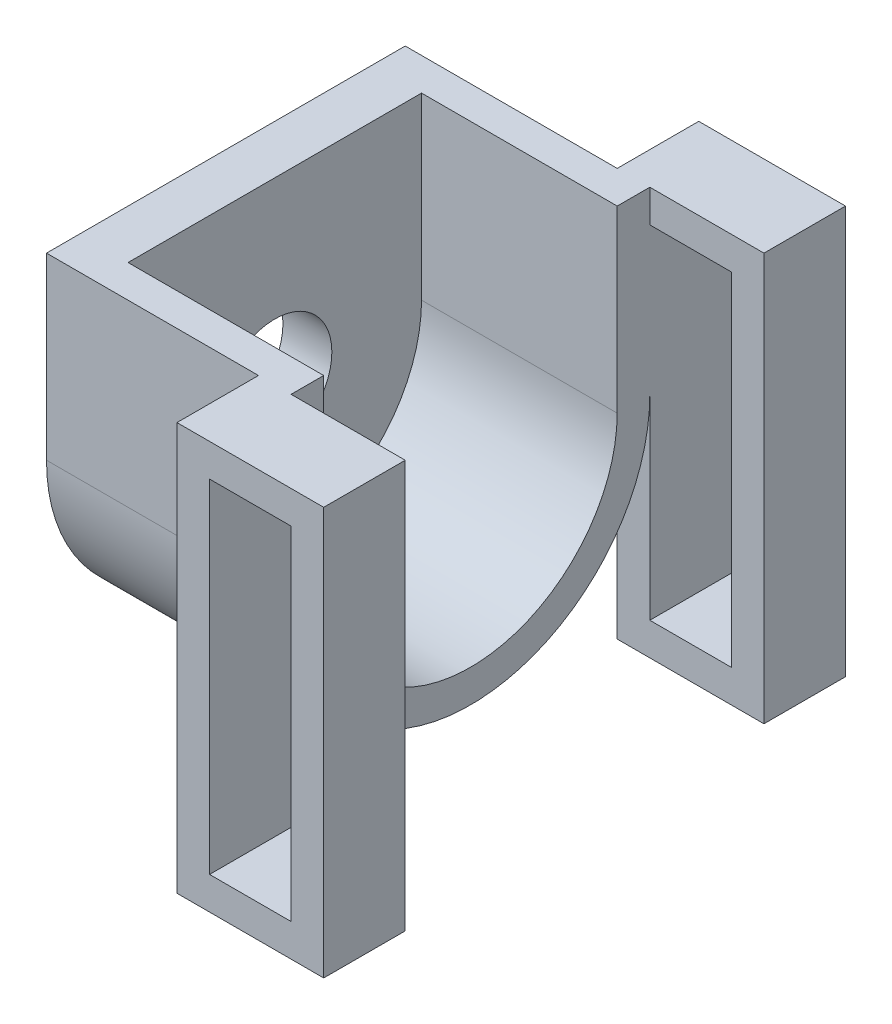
ISO-10303-21;
HEADER;
FILE_DESCRIPTION(('STEP AP214'),'2;1');
FILE_NAME('part.step','',(''),(''),'','','');
FILE_SCHEMA(('AUTOMOTIVE_DESIGN { 1 0 10303 214 1 1 1 1 }'));
ENDSEC;
DATA;
#1=APPLICATION_CONTEXT('core data for automotive mechanical design processes');
#2=APPLICATION_PROTOCOL_DEFINITION('international standard','automotive_design',2000,#1);
#3=PRODUCT_CONTEXT('',#1,'mechanical');
#4=PRODUCT('Part','Part','',(#3));
#5=PRODUCT_RELATED_PRODUCT_CATEGORY('part','',(#4));
#6=PRODUCT_DEFINITION_FORMATION('','',#4);
#7=PRODUCT_DEFINITION_CONTEXT('part definition',#1,'design');
#8=PRODUCT_DEFINITION('design','',#6,#7);
#9=PRODUCT_DEFINITION_SHAPE('','',#8);
#10=(LENGTH_UNIT() NAMED_UNIT(*) SI_UNIT(.MILLI.,.METRE.));
#11=(NAMED_UNIT(*) PLANE_ANGLE_UNIT() SI_UNIT($,.RADIAN.));
#12=(NAMED_UNIT(*) SI_UNIT($,.STERADIAN.) SOLID_ANGLE_UNIT());
#13=UNCERTAINTY_MEASURE_WITH_UNIT(LENGTH_MEASURE(1.E-05),#10,'distance_accuracy_value','');
#14=(GEOMETRIC_REPRESENTATION_CONTEXT(3) GLOBAL_UNCERTAINTY_ASSIGNED_CONTEXT((#13)) GLOBAL_UNIT_ASSIGNED_CONTEXT((#10,
#11,#12)) REPRESENTATION_CONTEXT('',''));
#15=CARTESIAN_POINT('',(0.,0.,0.));
#16=DIRECTION('',(0.,0.,1.));
#17=DIRECTION('',(1.,0.,0.));
#18=AXIS2_PLACEMENT_3D('',#15,#16,#17);
#19=CARTESIAN_POINT('',(15.,0.,0.));
#20=DIRECTION('',(1.,0.,0.));
#21=DIRECTION('',(0.,0.,-1.));
#22=AXIS2_PLACEMENT_3D('',#19,#20,#21);
#23=PLANE('',#22);
#24=DIRECTION('',(0.,1.,0.));
#25=VECTOR('',#24,1.);
#26=CARTESIAN_POINT('',(15.,0.,9.));
#27=LINE('',#26,#25);
#28=CARTESIAN_POINT('',(15.,0.,9.));
#29=VERTEX_POINT('',#28);
#30=CARTESIAN_POINT('',(15.,11.,9.));
#31=VERTEX_POINT('',#30);
#32=EDGE_CURVE('E384',#29,#31,#27,.T.);
#33=ORIENTED_EDGE('',*,*,#32,.T.);
#34=DIRECTION('',(0.,0.,1.));
#35=VECTOR('',#34,1.);
#36=CARTESIAN_POINT('',(15.,11.,11.));
#37=LINE('',#36,#35);
#38=CARTESIAN_POINT('',(15.,11.,11.));
#39=VERTEX_POINT('',#38);
#40=EDGE_CURVE('E433',#31,#39,#37,.T.);
#41=ORIENTED_EDGE('',*,*,#40,.T.);
#42=DIRECTION('',(0.,1.,0.));
#43=VECTOR('',#42,1.);
#44=CARTESIAN_POINT('',(15.,-14.,11.));
#45=LINE('',#44,#43);
#46=CARTESIAN_POINT('',(15.,9.,11.));
#47=VERTEX_POINT('',#46);
#48=EDGE_CURVE('E278',#47,#39,#45,.T.);
#49=ORIENTED_EDGE('',*,*,#48,.F.);
#50=DIRECTION('',(0.,0.,1.));
#51=VECTOR('',#50,1.);
#52=CARTESIAN_POINT('',(15.,9.,-16.));
#53=LINE('',#52,#51);
#54=CARTESIAN_POINT('',(15.,9.,16.));
#55=VERTEX_POINT('',#54);
#56=EDGE_CURVE('E264',#47,#55,#53,.T.);
#57=ORIENTED_EDGE('',*,*,#56,.T.);
#58=DIRECTION('',(0.,-1.,0.));
#59=VECTOR('',#58,1.);
#60=CARTESIAN_POINT('',(15.,9.,16.));
#61=LINE('',#60,#59);
#62=CARTESIAN_POINT('',(15.,-12.,16.));
#63=VERTEX_POINT('',#62);
#64=EDGE_CURVE('E234',#55,#63,#61,.T.);
#65=ORIENTED_EDGE('',*,*,#64,.T.);
#66=DIRECTION('',(0.,0.,1.));
#67=VECTOR('',#66,1.);
#68=CARTESIAN_POINT('',(15.,-12.,-16.));
#69=LINE('',#68,#67);
#70=CARTESIAN_POINT('',(15.,-12.,11.));
#71=VERTEX_POINT('',#70);
#72=EDGE_CURVE('E259',#71,#63,#69,.T.);
#73=ORIENTED_EDGE('',*,*,#72,.F.);
#74=DIRECTION('',(0.,-1.,0.));
#75=VECTOR('',#74,1.);
#76=CARTESIAN_POINT('',(15.,-14.,11.));
#77=LINE('',#76,#75);
#78=CARTESIAN_POINT('',(15.,0.,11.));
#79=VERTEX_POINT('',#78);
#80=EDGE_CURVE('E11',#79,#71,#77,.T.);
#81=ORIENTED_EDGE('',*,*,#80,.F.);
#82=CARTESIAN_POINT('',(15.,0.,0.));
#83=DIRECTION('',(1.,0.,0.));
#84=DIRECTION('',(0.,0.,-1.));
#85=AXIS2_PLACEMENT_3D('',#82,#83,#84);
#86=CIRCLE('',#85,11.);
#87=CARTESIAN_POINT('',(15.,0.,-11.));
#88=VERTEX_POINT('',#87);
#89=EDGE_CURVE('E429',#79,#88,#86,.T.);
#90=ORIENTED_EDGE('',*,*,#89,.T.);
#91=DIRECTION('',(0.,-1.,0.));
#92=VECTOR('',#91,1.);
#93=CARTESIAN_POINT('',(15.,-14.,-11.));
#94=LINE('',#93,#92);
#95=CARTESIAN_POINT('',(15.,-12.,-11.));
#96=VERTEX_POINT('',#95);
#97=EDGE_CURVE('E273',#88,#96,#94,.T.);
#98=ORIENTED_EDGE('',*,*,#97,.T.);
#99=CARTESIAN_POINT('',(15.,-12.,-16.));
#100=VERTEX_POINT('',#99);
#101=EDGE_CURVE('E255',#100,#96,#69,.T.);
#102=ORIENTED_EDGE('',*,*,#101,.F.);
#103=DIRECTION('',(0.,-1.,0.));
#104=VECTOR('',#103,1.);
#105=CARTESIAN_POINT('',(15.,9.,-16.));
#106=LINE('',#105,#104);
#107=CARTESIAN_POINT('',(15.,9.,-16.));
#108=VERTEX_POINT('',#107);
#109=EDGE_CURVE('E232',#108,#100,#106,.T.);
#110=ORIENTED_EDGE('',*,*,#109,.F.);
#111=CARTESIAN_POINT('',(15.,9.,-11.));
#112=VERTEX_POINT('',#111);
#113=EDGE_CURVE('E260',#108,#112,#53,.T.);
#114=ORIENTED_EDGE('',*,*,#113,.T.);
#115=DIRECTION('',(0.,1.,0.));
#116=VECTOR('',#115,1.);
#117=CARTESIAN_POINT('',(15.,-14.,-11.));
#118=LINE('',#117,#116);
#119=CARTESIAN_POINT('',(15.,11.,-11.));
#120=VERTEX_POINT('',#119);
#121=EDGE_CURVE('E344',#112,#120,#118,.T.);
#122=ORIENTED_EDGE('',*,*,#121,.T.);
#123=CARTESIAN_POINT('',(15.,11.,-9.));
#124=VERTEX_POINT('',#123);
#125=EDGE_CURVE('E435',#120,#124,#37,.T.);
#126=ORIENTED_EDGE('',*,*,#125,.T.);
#127=DIRECTION('',(0.,1.,0.));
#128=VECTOR('',#127,1.);
#129=CARTESIAN_POINT('',(15.,0.,-9.));
#130=LINE('',#129,#128);
#131=CARTESIAN_POINT('',(15.,0.,-9.));
#132=VERTEX_POINT('',#131);
#133=EDGE_CURVE('E408',#132,#124,#130,.T.);
#134=ORIENTED_EDGE('',*,*,#133,.F.);
#135=CARTESIAN_POINT('',(15.,0.,0.));
#136=DIRECTION('',(1.,0.,0.));
#137=DIRECTION('',(0.,0.,-1.));
#138=AXIS2_PLACEMENT_3D('',#135,#136,#137);
#139=CIRCLE('',#138,9.);
#140=EDGE_CURVE('E393',#29,#132,#139,.T.);
#141=ORIENTED_EDGE('',*,*,#140,.F.);
#142=EDGE_LOOP('',(#33,#41,#49,#57,#65,#73,#81,#90,#98,#102,#110,#114,#122,#126,#134,#141));
#143=FACE_BOUND('',#142,.T.);
#144=ADVANCED_FACE('F43',(#143),#23,.T.);
#145=CARTESIAN_POINT('',(15.,0.,11.));
#146=DIRECTION('',(0.,0.,-1.));
#147=DIRECTION('',(-1.,0.,0.));
#148=AXIS2_PLACEMENT_3D('',#145,#146,#147);
#149=PLANE('',#148);
#150=DIRECTION('',(0.,-1.,0.));
#151=VECTOR('',#150,1.);
#152=CARTESIAN_POINT('',(13.,11.,11.));
#153=LINE('',#152,#151);
#154=CARTESIAN_POINT('',(13.,11.,11.));
#155=VERTEX_POINT('',#154);
#156=CARTESIAN_POINT('',(13.,0.,11.));
#157=VERTEX_POINT('',#156);
#158=EDGE_CURVE('E313',#155,#157,#153,.T.);
#159=ORIENTED_EDGE('',*,*,#158,.F.);
#160=DIRECTION('',(-1.,0.,0.));
#161=VECTOR('',#160,1.);
#162=CARTESIAN_POINT('',(15.,11.,11.));
#163=LINE('',#162,#161);
#164=CARTESIAN_POINT('',(0.,11.,11.));
#165=VERTEX_POINT('',#164);
#166=EDGE_CURVE('E457',#155,#165,#163,.T.);
#167=ORIENTED_EDGE('',*,*,#166,.T.);
#168=DIRECTION('',(0.,-1.,0.));
#169=VECTOR('',#168,1.);
#170=CARTESIAN_POINT('',(0.,0.,11.));
#171=LINE('',#170,#169);
#172=CARTESIAN_POINT('',(0.,0.,11.));
#173=VERTEX_POINT('',#172);
#174=EDGE_CURVE('E434',#165,#173,#171,.T.);
#175=ORIENTED_EDGE('',*,*,#174,.T.);
#176=DIRECTION('',(-1.,0.,0.));
#177=VECTOR('',#176,1.);
#178=CARTESIAN_POINT('',(15.,0.,11.));
#179=LINE('',#178,#177);
#180=EDGE_CURVE('E439',#157,#173,#179,.T.);
#181=ORIENTED_EDGE('',*,*,#180,.F.);
#182=EDGE_LOOP('',(#159,#167,#175,#181));
#183=FACE_BOUND('',#182,.T.);
#184=ADVANCED_FACE('F529',(#183),#149,.F.);
#185=CARTESIAN_POINT('',(15.,11.,11.));
#186=DIRECTION('',(0.,-1.,0.));
#187=DIRECTION('',(0.,0.,-1.));
#188=AXIS2_PLACEMENT_3D('',#185,#186,#187);
#189=PLANE('',#188);
#190=DIRECTION('',(1.,0.,0.));
#191=VECTOR('',#190,1.);
#192=CARTESIAN_POINT('',(3.,11.,9.));
#193=LINE('',#192,#191);
#194=CARTESIAN_POINT('',(3.,11.,9.));
#195=VERTEX_POINT('',#194);
#196=EDGE_CURVE('E424',#195,#31,#193,.T.);
#197=ORIENTED_EDGE('',*,*,#196,.F.);
#198=DIRECTION('',(0.,0.,-1.));
#199=VECTOR('',#198,1.);
#200=CARTESIAN_POINT('',(3.,11.,9.));
#201=LINE('',#200,#199);
#202=CARTESIAN_POINT('',(3.,11.,-9.));
#203=VERTEX_POINT('',#202);
#204=EDGE_CURVE('E392',#195,#203,#201,.T.);
#205=ORIENTED_EDGE('',*,*,#204,.T.);
#206=DIRECTION('',(1.,0.,0.));
#207=VECTOR('',#206,1.);
#208=CARTESIAN_POINT('',(3.,11.,-9.));
#209=LINE('',#208,#207);
#210=EDGE_CURVE('E420',#203,#124,#209,.T.);
#211=ORIENTED_EDGE('',*,*,#210,.T.);
#212=ORIENTED_EDGE('',*,*,#125,.F.);
#213=DIRECTION('',(-1.,0.,0.));
#214=VECTOR('',#213,1.);
#215=CARTESIAN_POINT('',(22.,11.,-11.));
#216=LINE('',#215,#214);
#217=CARTESIAN_POINT('',(22.,11.,-11.));
#218=VERTEX_POINT('',#217);
#219=EDGE_CURVE('E343',#218,#120,#216,.T.);
#220=ORIENTED_EDGE('',*,*,#219,.F.);
#221=DIRECTION('',(0.,0.,-1.));
#222=VECTOR('',#221,1.);
#223=CARTESIAN_POINT('',(22.,11.,-11.));
#224=LINE('',#223,#222);
#225=CARTESIAN_POINT('',(22.,11.,-16.));
#226=VERTEX_POINT('',#225);
#227=EDGE_CURVE('E327',#218,#226,#224,.T.);
#228=ORIENTED_EDGE('',*,*,#227,.T.);
#229=DIRECTION('',(-1.,0.,0.));
#230=VECTOR('',#229,1.);
#231=CARTESIAN_POINT('',(15.,11.,-16.));
#232=LINE('',#231,#230);
#233=CARTESIAN_POINT('',(13.,11.,-16.));
#234=VERTEX_POINT('',#233);
#235=EDGE_CURVE('E369',#226,#234,#232,.T.);
#236=ORIENTED_EDGE('',*,*,#235,.T.);
#237=DIRECTION('',(0.,0.,1.));
#238=VECTOR('',#237,1.);
#239=CARTESIAN_POINT('',(13.,11.,-16.));
#240=LINE('',#239,#238);
#241=CARTESIAN_POINT('',(13.,11.,-11.));
#242=VERTEX_POINT('',#241);
#243=EDGE_CURVE('E373',#234,#242,#240,.T.);
#244=ORIENTED_EDGE('',*,*,#243,.T.);
#245=DIRECTION('',(-1.,0.,0.));
#246=VECTOR('',#245,1.);
#247=CARTESIAN_POINT('',(15.,11.,-11.));
#248=LINE('',#247,#246);
#249=CARTESIAN_POINT('',(0.,11.,-11.));
#250=VERTEX_POINT('',#249);
#251=EDGE_CURVE('E460',#242,#250,#248,.T.);
#252=ORIENTED_EDGE('',*,*,#251,.T.);
#253=DIRECTION('',(0.,0.,1.));
#254=VECTOR('',#253,1.);
#255=CARTESIAN_POINT('',(0.,11.,11.));
#256=LINE('',#255,#254);
#257=EDGE_CURVE('E447',#250,#165,#256,.T.);
#258=ORIENTED_EDGE('',*,*,#257,.T.);
#259=ORIENTED_EDGE('',*,*,#166,.F.);
#260=DIRECTION('',(0.,0.,-1.));
#261=VECTOR('',#260,1.);
#262=CARTESIAN_POINT('',(13.,11.,16.));
#263=LINE('',#262,#261);
#264=CARTESIAN_POINT('',(13.,11.,16.));
#265=VERTEX_POINT('',#264);
#266=EDGE_CURVE('E320',#265,#155,#263,.T.);
#267=ORIENTED_EDGE('',*,*,#266,.F.);
#268=DIRECTION('',(-1.,0.,0.));
#269=VECTOR('',#268,1.);
#270=CARTESIAN_POINT('',(15.,11.,16.));
#271=LINE('',#270,#269);
#272=CARTESIAN_POINT('',(22.,11.,16.));
#273=VERTEX_POINT('',#272);
#274=EDGE_CURVE('E317',#273,#265,#271,.T.);
#275=ORIENTED_EDGE('',*,*,#274,.F.);
#276=DIRECTION('',(0.,0.,1.));
#277=VECTOR('',#276,1.);
#278=CARTESIAN_POINT('',(22.,11.,11.));
#279=LINE('',#278,#277);
#280=CARTESIAN_POINT('',(22.,11.,11.));
#281=VERTEX_POINT('',#280);
#282=EDGE_CURVE('E279',#281,#273,#279,.T.);
#283=ORIENTED_EDGE('',*,*,#282,.F.);
#284=DIRECTION('',(-1.,0.,0.));
#285=VECTOR('',#284,1.);
#286=CARTESIAN_POINT('',(22.,11.,11.));
#287=LINE('',#286,#285);
#288=EDGE_CURVE('E294',#281,#39,#287,.T.);
#289=ORIENTED_EDGE('',*,*,#288,.T.);
#290=ORIENTED_EDGE('',*,*,#40,.F.);
#291=EDGE_LOOP('',(#197,#205,#211,#212,#220,#228,#236,#244,#252,#258,#259,#267,#275,#283,#289,#290));
#292=FACE_BOUND('',#291,.T.);
#293=ADVANCED_FACE('F510',(#292),#189,.F.);
#294=CARTESIAN_POINT('',(15.,0.,0.));
#295=DIRECTION('',(-1.,0.,0.));
#296=DIRECTION('',(0.,0.,1.));
#297=AXIS2_PLACEMENT_3D('',#294,#295,#296);
#298=CYLINDRICAL_SURFACE('',#297,11.);
#299=CARTESIAN_POINT('',(0.,0.,0.));
#300=DIRECTION('',(1.,0.,0.));
#301=DIRECTION('',(0.,0.,-1.));
#302=AXIS2_PLACEMENT_3D('',#299,#300,#301);
#303=CIRCLE('',#302,11.);
#304=CARTESIAN_POINT('',(0.,0.,-11.));
#305=VERTEX_POINT('',#304);
#306=EDGE_CURVE('E428',#173,#305,#303,.T.);
#307=ORIENTED_EDGE('',*,*,#306,.T.);
#308=DIRECTION('',(-1.,0.,0.));
#309=VECTOR('',#308,1.);
#310=CARTESIAN_POINT('',(15.,0.,-11.));
#311=LINE('',#310,#309);
#312=CARTESIAN_POINT('',(13.,0.,-11.));
#313=VERTEX_POINT('',#312);
#314=EDGE_CURVE('E463',#313,#305,#311,.T.);
#315=ORIENTED_EDGE('',*,*,#314,.F.);
#316=EDGE_CURVE('E348',#88,#313,#311,.T.);
#317=ORIENTED_EDGE('',*,*,#316,.F.);
#318=ORIENTED_EDGE('',*,*,#89,.F.);
#319=EDGE_CURVE('E454',#79,#157,#179,.T.);
#320=ORIENTED_EDGE('',*,*,#319,.T.);
#321=ORIENTED_EDGE('',*,*,#180,.T.);
#322=EDGE_LOOP('',(#307,#315,#317,#318,#320,#321));
#323=FACE_BOUND('',#322,.T.);
#324=ADVANCED_FACE('F45',(#323),#298,.T.);
#325=CARTESIAN_POINT('',(15.,0.,-11.));
#326=DIRECTION('',(0.,0.,1.));
#327=DIRECTION('',(1.,0.,0.));
#328=AXIS2_PLACEMENT_3D('',#325,#326,#327);
#329=PLANE('',#328);
#330=ORIENTED_EDGE('',*,*,#251,.F.);
#331=DIRECTION('',(0.,-1.,0.));
#332=VECTOR('',#331,1.);
#333=CARTESIAN_POINT('',(13.,11.,-11.));
#334=LINE('',#333,#332);
#335=EDGE_CURVE('E365',#242,#313,#334,.T.);
#336=ORIENTED_EDGE('',*,*,#335,.T.);
#337=ORIENTED_EDGE('',*,*,#314,.T.);
#338=DIRECTION('',(0.,1.,0.));
#339=VECTOR('',#338,1.);
#340=CARTESIAN_POINT('',(0.,0.,-11.));
#341=LINE('',#340,#339);
#342=EDGE_CURVE('E443',#305,#250,#341,.T.);
#343=ORIENTED_EDGE('',*,*,#342,.T.);
#344=EDGE_LOOP('',(#330,#336,#337,#343));
#345=FACE_BOUND('',#344,.T.);
#346=ADVANCED_FACE('F539',(#345),#329,.F.);
#347=CARTESIAN_POINT('',(0.,0.,0.));
#348=DIRECTION('',(1.,0.,0.));
#349=DIRECTION('',(0.,0.,-1.));
#350=AXIS2_PLACEMENT_3D('',#347,#348,#349);
#351=PLANE('',#350);
#352=CARTESIAN_POINT('',(0.,0.,0.));
#353=DIRECTION('',(1.,0.,0.));
#354=DIRECTION('',(0.,0.,-1.));
#355=AXIS2_PLACEMENT_3D('',#352,#353,#354);
#356=CIRCLE('',#355,3.5);
#357=CARTESIAN_POINT('',(0.,0.,-3.5));
#358=VERTEX_POINT('',#357);
#359=EDGE_CURVE('E380',#358,#358,#356,.T.);
#360=ORIENTED_EDGE('',*,*,#359,.T.);
#361=EDGE_LOOP('',(#360));
#362=FACE_BOUND('',#361,.T.);
#363=ORIENTED_EDGE('',*,*,#306,.F.);
#364=ORIENTED_EDGE('',*,*,#174,.F.);
#365=ORIENTED_EDGE('',*,*,#257,.F.);
#366=ORIENTED_EDGE('',*,*,#342,.F.);
#367=EDGE_LOOP('',(#363,#364,#365,#366));
#368=FACE_BOUND('',#367,.T.);
#369=ADVANCED_FACE('F543',(#362,#368),#351,.F.);
#370=CARTESIAN_POINT('',(3.,0.,9.));
#371=DIRECTION('',(0.,0.,-1.));
#372=DIRECTION('',(-1.,0.,0.));
#373=AXIS2_PLACEMENT_3D('',#370,#371,#372);
#374=PLANE('',#373);
#375=ORIENTED_EDGE('',*,*,#32,.F.);
#376=DIRECTION('',(1.,0.,0.));
#377=VECTOR('',#376,1.);
#378=CARTESIAN_POINT('',(3.,0.,9.));
#379=LINE('',#378,#377);
#380=CARTESIAN_POINT('',(3.,0.,9.));
#381=VERTEX_POINT('',#380);
#382=EDGE_CURVE('E405',#381,#29,#379,.T.);
#383=ORIENTED_EDGE('',*,*,#382,.F.);
#384=DIRECTION('',(0.,1.,0.));
#385=VECTOR('',#384,1.);
#386=CARTESIAN_POINT('',(3.,0.,9.));
#387=LINE('',#386,#385);
#388=EDGE_CURVE('E388',#381,#195,#387,.T.);
#389=ORIENTED_EDGE('',*,*,#388,.T.);
#390=ORIENTED_EDGE('',*,*,#196,.T.);
#391=EDGE_LOOP('',(#375,#383,#389,#390));
#392=FACE_BOUND('',#391,.T.);
#393=ADVANCED_FACE('F567',(#392),#374,.T.);
#394=CARTESIAN_POINT('',(3.,0.,-9.));
#395=DIRECTION('',(0.,0.,-1.));
#396=DIRECTION('',(-1.,0.,0.));
#397=AXIS2_PLACEMENT_3D('',#394,#395,#396);
#398=PLANE('',#397);
#399=ORIENTED_EDGE('',*,*,#133,.T.);
#400=ORIENTED_EDGE('',*,*,#210,.F.);
#401=DIRECTION('',(0.,1.,0.));
#402=VECTOR('',#401,1.);
#403=CARTESIAN_POINT('',(3.,0.,-9.));
#404=LINE('',#403,#402);
#405=CARTESIAN_POINT('',(3.,0.,-9.));
#406=VERTEX_POINT('',#405);
#407=EDGE_CURVE('E397',#406,#203,#404,.T.);
#408=ORIENTED_EDGE('',*,*,#407,.F.);
#409=DIRECTION('',(1.,0.,0.));
#410=VECTOR('',#409,1.);
#411=CARTESIAN_POINT('',(3.,0.,-9.));
#412=LINE('',#411,#410);
#413=EDGE_CURVE('E417',#406,#132,#412,.T.);
#414=ORIENTED_EDGE('',*,*,#413,.T.);
#415=EDGE_LOOP('',(#399,#400,#408,#414));
#416=FACE_BOUND('',#415,.T.);
#417=ADVANCED_FACE('F559',(#416),#398,.F.);
#418=CARTESIAN_POINT('',(3.,0.,0.));
#419=DIRECTION('',(1.,0.,0.));
#420=DIRECTION('',(0.,0.,-1.));
#421=AXIS2_PLACEMENT_3D('',#418,#419,#420);
#422=CYLINDRICAL_SURFACE('',#421,9.);
#423=ORIENTED_EDGE('',*,*,#140,.T.);
#424=ORIENTED_EDGE('',*,*,#413,.F.);
#425=CARTESIAN_POINT('',(3.,0.,0.));
#426=DIRECTION('',(1.,0.,0.));
#427=DIRECTION('',(0.,0.,-1.));
#428=AXIS2_PLACEMENT_3D('',#425,#426,#427);
#429=CIRCLE('',#428,9.);
#430=EDGE_CURVE('E401',#381,#406,#429,.T.);
#431=ORIENTED_EDGE('',*,*,#430,.F.);
#432=ORIENTED_EDGE('',*,*,#382,.T.);
#433=EDGE_LOOP('',(#423,#424,#431,#432));
#434=FACE_BOUND('',#433,.T.);
#435=ADVANCED_FACE('F565',(#434),#422,.F.);
#436=CARTESIAN_POINT('',(3.,0.,0.));
#437=DIRECTION('',(1.,0.,0.));
#438=DIRECTION('',(0.,0.,-1.));
#439=AXIS2_PLACEMENT_3D('',#436,#437,#438);
#440=PLANE('',#439);
#441=CARTESIAN_POINT('',(3.,0.,0.));
#442=DIRECTION('',(1.,0.,0.));
#443=DIRECTION('',(0.,0.,-1.));
#444=AXIS2_PLACEMENT_3D('',#441,#442,#443);
#445=CIRCLE('',#444,3.5);
#446=CARTESIAN_POINT('',(3.,0.,-3.5));
#447=VERTEX_POINT('',#446);
#448=EDGE_CURVE('E379',#447,#447,#445,.T.);
#449=ORIENTED_EDGE('',*,*,#448,.F.);
#450=EDGE_LOOP('',(#449));
#451=FACE_BOUND('',#450,.T.);
#452=ORIENTED_EDGE('',*,*,#388,.F.);
#453=ORIENTED_EDGE('',*,*,#430,.T.);
#454=ORIENTED_EDGE('',*,*,#407,.T.);
#455=ORIENTED_EDGE('',*,*,#204,.F.);
#456=EDGE_LOOP('',(#452,#453,#454,#455));
#457=FACE_BOUND('',#456,.T.);
#458=ADVANCED_FACE('F562',(#451,#457),#440,.T.);
#459=CARTESIAN_POINT('',(0.,0.,0.));
#460=DIRECTION('',(1.,0.,0.));
#461=DIRECTION('',(0.,0.,-1.));
#462=AXIS2_PLACEMENT_3D('',#459,#460,#461);
#463=CYLINDRICAL_SURFACE('',#462,3.5);
#464=ORIENTED_EDGE('',*,*,#359,.F.);
#465=EDGE_LOOP('',(#464));
#466=FACE_BOUND('',#465,.T.);
#467=ORIENTED_EDGE('',*,*,#448,.T.);
#468=EDGE_LOOP('',(#467));
#469=FACE_BOUND('',#468,.T.);
#470=ADVANCED_FACE('F848',(#466,#469),#463,.F.);
#471=CARTESIAN_POINT('',(13.,11.,-16.));
#472=DIRECTION('',(-1.,0.,0.));
#473=DIRECTION('',(0.,-1.,0.));
#474=AXIS2_PLACEMENT_3D('',#471,#472,#473);
#475=PLANE('',#474);
#476=ORIENTED_EDGE('',*,*,#335,.F.);
#477=ORIENTED_EDGE('',*,*,#243,.F.);
#478=DIRECTION('',(0.,-1.,0.));
#479=VECTOR('',#478,1.);
#480=CARTESIAN_POINT('',(13.,11.,-16.));
#481=LINE('',#480,#479);
#482=CARTESIAN_POINT('',(13.,-14.,-16.));
#483=VERTEX_POINT('',#482);
#484=EDGE_CURVE('E366',#234,#483,#481,.T.);
#485=ORIENTED_EDGE('',*,*,#484,.T.);
#486=DIRECTION('',(0.,0.,-1.));
#487=VECTOR('',#486,1.);
#488=CARTESIAN_POINT('',(13.,-14.,-11.));
#489=LINE('',#488,#487);
#490=CARTESIAN_POINT('',(13.,-14.,-11.));
#491=VERTEX_POINT('',#490);
#492=EDGE_CURVE('E358',#491,#483,#489,.T.);
#493=ORIENTED_EDGE('',*,*,#492,.F.);
#494=DIRECTION('',(0.,1.,0.));
#495=VECTOR('',#494,1.);
#496=CARTESIAN_POINT('',(13.,-14.,-11.));
#497=LINE('',#496,#495);
#498=EDGE_CURVE('E362',#491,#313,#497,.T.);
#499=ORIENTED_EDGE('',*,*,#498,.T.);
#500=EDGE_LOOP('',(#476,#477,#485,#493,#499));
#501=FACE_BOUND('',#500,.T.);
#502=ADVANCED_FACE('F547',(#501),#475,.T.);
#503=CARTESIAN_POINT('',(0.,0.,-16.));
#504=DIRECTION('',(0.,0.,1.));
#505=DIRECTION('',(1.,0.,0.));
#506=AXIS2_PLACEMENT_3D('',#503,#504,#505);
#507=PLANE('',#506);
#508=ORIENTED_EDGE('',*,*,#109,.T.);
#509=DIRECTION('',(1.,0.,0.));
#510=VECTOR('',#509,1.);
#511=CARTESIAN_POINT('',(15.,-12.,-16.));
#512=LINE('',#511,#510);
#513=CARTESIAN_POINT('',(20.,-12.,-16.));
#514=VERTEX_POINT('',#513);
#515=EDGE_CURVE('E215',#100,#514,#512,.T.);
#516=ORIENTED_EDGE('',*,*,#515,.T.);
#517=DIRECTION('',(0.,-1.,0.));
#518=VECTOR('',#517,1.);
#519=CARTESIAN_POINT('',(20.,9.,-16.));
#520=LINE('',#519,#518);
#521=CARTESIAN_POINT('',(20.,9.,-16.));
#522=VERTEX_POINT('',#521);
#523=EDGE_CURVE('E208',#522,#514,#520,.T.);
#524=ORIENTED_EDGE('',*,*,#523,.F.);
#525=DIRECTION('',(1.,0.,0.));
#526=VECTOR('',#525,1.);
#527=CARTESIAN_POINT('',(15.,9.,-16.));
#528=LINE('',#527,#526);
#529=EDGE_CURVE('E214',#108,#522,#528,.T.);
#530=ORIENTED_EDGE('',*,*,#529,.F.);
#531=EDGE_LOOP('',(#508,#516,#524,#530));
#532=FACE_BOUND('',#531,.T.);
#533=ORIENTED_EDGE('',*,*,#235,.F.);
#534=DIRECTION('',(0.,1.,0.));
#535=VECTOR('',#534,1.);
#536=CARTESIAN_POINT('',(22.,-14.,-16.));
#537=LINE('',#536,#535);
#538=CARTESIAN_POINT('',(22.,-14.,-16.));
#539=VERTEX_POINT('',#538);
#540=EDGE_CURVE('E331',#539,#226,#537,.T.);
#541=ORIENTED_EDGE('',*,*,#540,.F.);
#542=DIRECTION('',(1.,0.,0.));
#543=VECTOR('',#542,1.);
#544=CARTESIAN_POINT('',(13.,-14.,-16.));
#545=LINE('',#544,#543);
#546=EDGE_CURVE('E352',#483,#539,#545,.T.);
#547=ORIENTED_EDGE('',*,*,#546,.F.);
#548=ORIENTED_EDGE('',*,*,#484,.F.);
#549=EDGE_LOOP('',(#533,#541,#547,#548));
#550=FACE_BOUND('',#549,.T.);
#551=ADVANCED_FACE('F229',(#532,#550),#507,.F.);
#552=CARTESIAN_POINT('',(13.,-14.,-11.));
#553=DIRECTION('',(0.,0.,1.));
#554=DIRECTION('',(1.,0.,0.));
#555=AXIS2_PLACEMENT_3D('',#552,#553,#554);
#556=PLANE('',#555);
#557=ORIENTED_EDGE('',*,*,#97,.F.);
#558=ORIENTED_EDGE('',*,*,#316,.T.);
#559=ORIENTED_EDGE('',*,*,#498,.F.);
#560=DIRECTION('',(1.,0.,0.));
#561=VECTOR('',#560,1.);
#562=CARTESIAN_POINT('',(13.,-14.,-11.));
#563=LINE('',#562,#561);
#564=CARTESIAN_POINT('',(22.,-14.,-11.));
#565=VERTEX_POINT('',#564);
#566=EDGE_CURVE('E355',#491,#565,#563,.T.);
#567=ORIENTED_EDGE('',*,*,#566,.T.);
#568=DIRECTION('',(0.,1.,0.));
#569=VECTOR('',#568,1.);
#570=CARTESIAN_POINT('',(22.,-14.,-11.));
#571=LINE('',#570,#569);
#572=EDGE_CURVE('E339',#565,#218,#571,.T.);
#573=ORIENTED_EDGE('',*,*,#572,.T.);
#574=ORIENTED_EDGE('',*,*,#219,.T.);
#575=ORIENTED_EDGE('',*,*,#121,.F.);
#576=DIRECTION('',(1.,0.,0.));
#577=VECTOR('',#576,1.);
#578=CARTESIAN_POINT('',(13.,9.,-11.));
#579=LINE('',#578,#577);
#580=CARTESIAN_POINT('',(20.,9.,-11.));
#581=VERTEX_POINT('',#580);
#582=EDGE_CURVE('E269',#112,#581,#579,.T.);
#583=ORIENTED_EDGE('',*,*,#582,.T.);
#584=DIRECTION('',(0.,-1.,0.));
#585=VECTOR('',#584,1.);
#586=CARTESIAN_POINT('',(20.,-14.,-11.));
#587=LINE('',#586,#585);
#588=CARTESIAN_POINT('',(20.,-12.,-11.));
#589=VERTEX_POINT('',#588);
#590=EDGE_CURVE('E258',#581,#589,#587,.T.);
#591=ORIENTED_EDGE('',*,*,#590,.T.);
#592=DIRECTION('',(1.,0.,0.));
#593=VECTOR('',#592,1.);
#594=CARTESIAN_POINT('',(13.,-12.,-11.));
#595=LINE('',#594,#593);
#596=EDGE_CURVE('E223',#96,#589,#595,.T.);
#597=ORIENTED_EDGE('',*,*,#596,.F.);
#598=EDGE_LOOP('',(#557,#558,#559,#567,#573,#574,#575,#583,#591,#597));
#599=FACE_BOUND('',#598,.T.);
#600=ADVANCED_FACE('F551',(#599),#556,.T.);
#601=CARTESIAN_POINT('',(0.,-14.,0.));
#602=DIRECTION('',(0.,1.,0.));
#603=DIRECTION('',(0.,0.,1.));
#604=AXIS2_PLACEMENT_3D('',#601,#602,#603);
#605=PLANE('',#604);
#606=ORIENTED_EDGE('',*,*,#546,.T.);
#607=DIRECTION('',(0.,0.,-1.));
#608=VECTOR('',#607,1.);
#609=CARTESIAN_POINT('',(22.,-14.,-11.));
#610=LINE('',#609,#608);
#611=EDGE_CURVE('E335',#565,#539,#610,.T.);
#612=ORIENTED_EDGE('',*,*,#611,.F.);
#613=ORIENTED_EDGE('',*,*,#566,.F.);
#614=ORIENTED_EDGE('',*,*,#492,.T.);
#615=EDGE_LOOP('',(#606,#612,#613,#614));
#616=FACE_BOUND('',#615,.T.);
#617=ADVANCED_FACE('F772',(#616),#605,.F.);
#618=CARTESIAN_POINT('',(22.,0.,0.));
#619=DIRECTION('',(1.,0.,0.));
#620=DIRECTION('',(0.,0.,-1.));
#621=AXIS2_PLACEMENT_3D('',#618,#619,#620);
#622=PLANE('',#621);
#623=ORIENTED_EDGE('',*,*,#227,.F.);
#624=ORIENTED_EDGE('',*,*,#572,.F.);
#625=ORIENTED_EDGE('',*,*,#611,.T.);
#626=ORIENTED_EDGE('',*,*,#540,.T.);
#627=EDGE_LOOP('',(#623,#624,#625,#626));
#628=FACE_BOUND('',#627,.T.);
#629=ADVANCED_FACE('F608',(#628),#622,.T.);
#630=CARTESIAN_POINT('',(13.,11.,16.));
#631=DIRECTION('',(1.,0.,0.));
#632=DIRECTION('',(0.,1.,0.));
#633=AXIS2_PLACEMENT_3D('',#630,#631,#632);
#634=PLANE('',#633);
#635=ORIENTED_EDGE('',*,*,#158,.T.);
#636=DIRECTION('',(0.,1.,0.));
#637=VECTOR('',#636,1.);
#638=CARTESIAN_POINT('',(13.,-14.,11.));
#639=LINE('',#638,#637);
#640=CARTESIAN_POINT('',(13.,-14.,11.));
#641=VERTEX_POINT('',#640);
#642=EDGE_CURVE('E309',#641,#157,#639,.T.);
#643=ORIENTED_EDGE('',*,*,#642,.F.);
#644=DIRECTION('',(0.,0.,-1.));
#645=VECTOR('',#644,1.);
#646=CARTESIAN_POINT('',(13.,-14.,16.));
#647=LINE('',#646,#645);
#648=CARTESIAN_POINT('',(13.,-14.,16.));
#649=VERTEX_POINT('',#648);
#650=EDGE_CURVE('E306',#649,#641,#647,.T.);
#651=ORIENTED_EDGE('',*,*,#650,.F.);
#652=DIRECTION('',(0.,-1.,0.));
#653=VECTOR('',#652,1.);
#654=CARTESIAN_POINT('',(13.,11.,16.));
#655=LINE('',#654,#653);
#656=EDGE_CURVE('E314',#265,#649,#655,.T.);
#657=ORIENTED_EDGE('',*,*,#656,.F.);
#658=ORIENTED_EDGE('',*,*,#266,.T.);
#659=EDGE_LOOP('',(#635,#643,#651,#657,#658));
#660=FACE_BOUND('',#659,.T.);
#661=ADVANCED_FACE('F524',(#660),#634,.F.);
#662=CARTESIAN_POINT('',(0.,0.,16.));
#663=DIRECTION('',(0.,0.,1.));
#664=DIRECTION('',(1.,0.,0.));
#665=AXIS2_PLACEMENT_3D('',#662,#663,#664);
#666=PLANE('',#665);
#667=DIRECTION('',(1.,0.,0.));
#668=VECTOR('',#667,1.);
#669=CARTESIAN_POINT('',(15.,-12.,16.));
#670=LINE('',#669,#668);
#671=CARTESIAN_POINT('',(20.,-12.,16.));
#672=VERTEX_POINT('',#671);
#673=EDGE_CURVE('E245',#63,#672,#670,.T.);
#674=ORIENTED_EDGE('',*,*,#673,.F.);
#675=ORIENTED_EDGE('',*,*,#64,.F.);
#676=DIRECTION('',(1.,0.,0.));
#677=VECTOR('',#676,1.);
#678=CARTESIAN_POINT('',(15.,9.,16.));
#679=LINE('',#678,#677);
#680=CARTESIAN_POINT('',(20.,9.,16.));
#681=VERTEX_POINT('',#680);
#682=EDGE_CURVE('E238',#55,#681,#679,.T.);
#683=ORIENTED_EDGE('',*,*,#682,.T.);
#684=DIRECTION('',(0.,-1.,0.));
#685=VECTOR('',#684,1.);
#686=CARTESIAN_POINT('',(20.,9.,16.));
#687=LINE('',#686,#685);
#688=EDGE_CURVE('E248',#681,#672,#687,.T.);
#689=ORIENTED_EDGE('',*,*,#688,.T.);
#690=EDGE_LOOP('',(#674,#675,#683,#689));
#691=FACE_BOUND('',#690,.T.);
#692=ORIENTED_EDGE('',*,*,#656,.T.);
#693=DIRECTION('',(1.,0.,0.));
#694=VECTOR('',#693,1.);
#695=CARTESIAN_POINT('',(13.,-14.,16.));
#696=LINE('',#695,#694);
#697=CARTESIAN_POINT('',(22.,-14.,16.));
#698=VERTEX_POINT('',#697);
#699=EDGE_CURVE('E303',#649,#698,#696,.T.);
#700=ORIENTED_EDGE('',*,*,#699,.T.);
#701=DIRECTION('',(0.,1.,0.));
#702=VECTOR('',#701,1.);
#703=CARTESIAN_POINT('',(22.,-14.,16.));
#704=LINE('',#703,#702);
#705=EDGE_CURVE('E283',#698,#273,#704,.T.);
#706=ORIENTED_EDGE('',*,*,#705,.T.);
#707=ORIENTED_EDGE('',*,*,#274,.T.);
#708=EDGE_LOOP('',(#692,#700,#706,#707));
#709=FACE_BOUND('',#708,.T.);
#710=ADVANCED_FACE('F496',(#691,#709),#666,.T.);
#711=CARTESIAN_POINT('',(13.,-14.,11.));
#712=DIRECTION('',(0.,0.,1.));
#713=DIRECTION('',(1.,0.,0.));
#714=AXIS2_PLACEMENT_3D('',#711,#712,#713);
#715=PLANE('',#714);
#716=ORIENTED_EDGE('',*,*,#319,.F.);
#717=ORIENTED_EDGE('',*,*,#80,.T.);
#718=DIRECTION('',(1.,0.,0.));
#719=VECTOR('',#718,1.);
#720=CARTESIAN_POINT('',(13.,-12.,11.));
#721=LINE('',#720,#719);
#722=CARTESIAN_POINT('',(20.,-12.,11.));
#723=VERTEX_POINT('',#722);
#724=EDGE_CURVE('E52',#71,#723,#721,.T.);
#725=ORIENTED_EDGE('',*,*,#724,.T.);
#726=DIRECTION('',(0.,-1.,0.));
#727=VECTOR('',#726,1.);
#728=CARTESIAN_POINT('',(20.,-14.,11.));
#729=LINE('',#728,#727);
#730=CARTESIAN_POINT('',(20.,9.,11.));
#731=VERTEX_POINT('',#730);
#732=EDGE_CURVE('E347',#731,#723,#729,.T.);
#733=ORIENTED_EDGE('',*,*,#732,.F.);
#734=DIRECTION('',(1.,0.,0.));
#735=VECTOR('',#734,1.);
#736=CARTESIAN_POINT('',(13.,9.,11.));
#737=LINE('',#736,#735);
#738=EDGE_CURVE('E469',#47,#731,#737,.T.);
#739=ORIENTED_EDGE('',*,*,#738,.F.);
#740=ORIENTED_EDGE('',*,*,#48,.T.);
#741=ORIENTED_EDGE('',*,*,#288,.F.);
#742=DIRECTION('',(0.,1.,0.));
#743=VECTOR('',#742,1.);
#744=CARTESIAN_POINT('',(22.,-14.,11.));
#745=LINE('',#744,#743);
#746=CARTESIAN_POINT('',(22.,-14.,11.));
#747=VERTEX_POINT('',#746);
#748=EDGE_CURVE('E291',#747,#281,#745,.T.);
#749=ORIENTED_EDGE('',*,*,#748,.F.);
#750=DIRECTION('',(1.,0.,0.));
#751=VECTOR('',#750,1.);
#752=CARTESIAN_POINT('',(13.,-14.,11.));
#753=LINE('',#752,#751);
#754=EDGE_CURVE('E300',#641,#747,#753,.T.);
#755=ORIENTED_EDGE('',*,*,#754,.F.);
#756=ORIENTED_EDGE('',*,*,#642,.T.);
#757=EDGE_LOOP('',(#716,#717,#725,#733,#739,#740,#741,#749,#755,#756));
#758=FACE_BOUND('',#757,.T.);
#759=ADVANCED_FACE('F477',(#758),#715,.F.);
#760=CARTESIAN_POINT('',(0.,-14.,0.));
#761=DIRECTION('',(0.,1.,0.));
#762=DIRECTION('',(-1.,0.,0.));
#763=AXIS2_PLACEMENT_3D('',#760,#761,#762);
#764=PLANE('',#763);
#765=ORIENTED_EDGE('',*,*,#754,.T.);
#766=DIRECTION('',(0.,0.,1.));
#767=VECTOR('',#766,1.);
#768=CARTESIAN_POINT('',(22.,-14.,11.));
#769=LINE('',#768,#767);
#770=EDGE_CURVE('E287',#747,#698,#769,.T.);
#771=ORIENTED_EDGE('',*,*,#770,.T.);
#772=ORIENTED_EDGE('',*,*,#699,.F.);
#773=ORIENTED_EDGE('',*,*,#650,.T.);
#774=EDGE_LOOP('',(#765,#771,#772,#773));
#775=FACE_BOUND('',#774,.T.);
#776=ADVANCED_FACE('F519',(#775),#764,.F.);
#777=CARTESIAN_POINT('',(22.,0.,0.));
#778=DIRECTION('',(-1.,0.,0.));
#779=DIRECTION('',(0.,0.,1.));
#780=AXIS2_PLACEMENT_3D('',#777,#778,#779);
#781=PLANE('',#780);
#782=ORIENTED_EDGE('',*,*,#282,.T.);
#783=ORIENTED_EDGE('',*,*,#705,.F.);
#784=ORIENTED_EDGE('',*,*,#770,.F.);
#785=ORIENTED_EDGE('',*,*,#748,.T.);
#786=EDGE_LOOP('',(#782,#783,#784,#785));
#787=FACE_BOUND('',#786,.T.);
#788=ADVANCED_FACE('F516',(#787),#781,.F.);
#789=CARTESIAN_POINT('',(20.,9.,-16.));
#790=DIRECTION('',(-1.,0.,0.));
#791=DIRECTION('',(0.,-1.,0.));
#792=AXIS2_PLACEMENT_3D('',#789,#790,#791);
#793=PLANE('',#792);
#794=ORIENTED_EDGE('',*,*,#732,.T.);
#795=DIRECTION('',(0.,0.,1.));
#796=VECTOR('',#795,1.);
#797=CARTESIAN_POINT('',(20.,-12.,-16.));
#798=LINE('',#797,#796);
#799=EDGE_CURVE('E227',#723,#672,#798,.T.);
#800=ORIENTED_EDGE('',*,*,#799,.T.);
#801=ORIENTED_EDGE('',*,*,#688,.F.);
#802=DIRECTION('',(0.,0.,1.));
#803=VECTOR('',#802,1.);
#804=CARTESIAN_POINT('',(20.,9.,-16.));
#805=LINE('',#804,#803);
#806=EDGE_CURVE('E226',#731,#681,#805,.T.);
#807=ORIENTED_EDGE('',*,*,#806,.F.);
#808=EDGE_LOOP('',(#794,#800,#801,#807));
#809=FACE_BOUND('',#808,.T.);
#810=ADVANCED_FACE('F494',(#809),#793,.T.);
#811=CARTESIAN_POINT('',(15.,9.,-16.));
#812=DIRECTION('',(0.,-1.,0.));
#813=DIRECTION('',(0.,0.,-1.));
#814=AXIS2_PLACEMENT_3D('',#811,#812,#813);
#815=PLANE('',#814);
#816=ORIENTED_EDGE('',*,*,#738,.T.);
#817=ORIENTED_EDGE('',*,*,#806,.T.);
#818=ORIENTED_EDGE('',*,*,#682,.F.);
#819=ORIENTED_EDGE('',*,*,#56,.F.);
#820=EDGE_LOOP('',(#816,#817,#818,#819));
#821=FACE_BOUND('',#820,.T.);
#822=ADVANCED_FACE('F500',(#821),#815,.T.);
#823=CARTESIAN_POINT('',(15.,-12.,-16.));
#824=DIRECTION('',(0.,-1.,0.));
#825=DIRECTION('',(0.,0.,-1.));
#826=AXIS2_PLACEMENT_3D('',#823,#824,#825);
#827=PLANE('',#826);
#828=ORIENTED_EDGE('',*,*,#72,.T.);
#829=ORIENTED_EDGE('',*,*,#673,.T.);
#830=ORIENTED_EDGE('',*,*,#799,.F.);
#831=ORIENTED_EDGE('',*,*,#724,.F.);
#832=EDGE_LOOP('',(#828,#829,#830,#831));
#833=FACE_BOUND('',#832,.T.);
#834=ADVANCED_FACE('F482',(#833),#827,.F.);
#835=ORIENTED_EDGE('',*,*,#596,.T.);
#836=EDGE_CURVE('E64',#514,#589,#798,.T.);
#837=ORIENTED_EDGE('',*,*,#836,.F.);
#838=ORIENTED_EDGE('',*,*,#515,.F.);
#839=ORIENTED_EDGE('',*,*,#101,.T.);
#840=EDGE_LOOP('',(#835,#837,#838,#839));
#841=FACE_BOUND('',#840,.T.);
#842=ADVANCED_FACE('F219',(#841),#827,.F.);
#843=ORIENTED_EDGE('',*,*,#113,.F.);
#844=ORIENTED_EDGE('',*,*,#529,.T.);
#845=EDGE_CURVE('E59',#522,#581,#805,.T.);
#846=ORIENTED_EDGE('',*,*,#845,.T.);
#847=ORIENTED_EDGE('',*,*,#582,.F.);
#848=EDGE_LOOP('',(#843,#844,#846,#847));
#849=FACE_BOUND('',#848,.T.);
#850=ADVANCED_FACE('F554',(#849),#815,.T.);
#851=ORIENTED_EDGE('',*,*,#845,.F.);
#852=ORIENTED_EDGE('',*,*,#523,.T.);
#853=ORIENTED_EDGE('',*,*,#836,.T.);
#854=ORIENTED_EDGE('',*,*,#590,.F.);
#855=EDGE_LOOP('',(#851,#852,#853,#854));
#856=FACE_BOUND('',#855,.T.);
#857=ADVANCED_FACE('F209',(#856),#793,.T.);
#858=CLOSED_SHELL('',(#144,#184,#293,#324,#346,#369,#393,#417,#435,#458,#470,#502,#551,#600,
#617,#629,#661,#710,#759,#776,#788,#810,#822,#834,#842,#850,#857));
#859=MANIFOLD_SOLID_BREP('B2',#858);
#860=ADVANCED_BREP_SHAPE_REPRESENTATION('',(#18,#859),#14);
#861=SHAPE_DEFINITION_REPRESENTATION(#9,#860);
ENDSEC;
END-ISO-10303-21;
